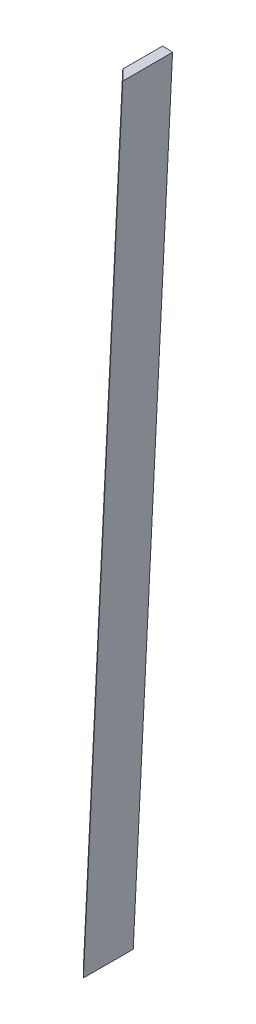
ISO-10303-21;
HEADER;
FILE_DESCRIPTION(('STEP AP214'),'2;1');
FILE_NAME('part.step','',(''),(''),'','','');
FILE_SCHEMA(('AUTOMOTIVE_DESIGN { 1 0 10303 214 1 1 1 1 }'));
ENDSEC;
DATA;
#1=APPLICATION_CONTEXT('core data for automotive mechanical design processes');
#2=APPLICATION_PROTOCOL_DEFINITION('international standard','automotive_design',2000,#1);
#3=PRODUCT_CONTEXT('',#1,'mechanical');
#4=PRODUCT('Part','Part','',(#3));
#5=PRODUCT_RELATED_PRODUCT_CATEGORY('part','',(#4));
#6=PRODUCT_DEFINITION_FORMATION('','',#4);
#7=PRODUCT_DEFINITION_CONTEXT('part definition',#1,'design');
#8=PRODUCT_DEFINITION('design','',#6,#7);
#9=PRODUCT_DEFINITION_SHAPE('','',#8);
#10=(LENGTH_UNIT() NAMED_UNIT(*) SI_UNIT(.MILLI.,.METRE.));
#11=(NAMED_UNIT(*) PLANE_ANGLE_UNIT() SI_UNIT($,.RADIAN.));
#12=(NAMED_UNIT(*) SI_UNIT($,.STERADIAN.) SOLID_ANGLE_UNIT());
#13=UNCERTAINTY_MEASURE_WITH_UNIT(LENGTH_MEASURE(1.E-05),#10,'distance_accuracy_value','');
#14=(GEOMETRIC_REPRESENTATION_CONTEXT(3) GLOBAL_UNCERTAINTY_ASSIGNED_CONTEXT((#13)) GLOBAL_UNIT_ASSIGNED_CONTEXT((#10,
#11,#12)) REPRESENTATION_CONTEXT('',''));
#15=CARTESIAN_POINT('',(0.,0.,0.));
#16=DIRECTION('',(0.,0.,1.));
#17=DIRECTION('',(1.,0.,0.));
#18=AXIS2_PLACEMENT_3D('',#15,#16,#17);
#19=CARTESIAN_POINT('',(183.577448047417,4000.68963069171,-264.150699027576));
#20=DIRECTION('',(0.000608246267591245,-3.00385009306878E-05,-0.999999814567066));
#21=DIRECTION('',(-0.999999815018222,0.,-0.000608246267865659));
#22=AXIS2_PLACEMENT_3D('',#19,#20,#21);
#23=PLANE('',#22);
#24=DIRECTION('',(-0.0493253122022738,-0.998782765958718,0.));
#25=VECTOR('',#24,1.);
#26=CARTESIAN_POINT('',(183.577448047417,4000.68963069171,-264.150699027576));
#27=LINE('',#26,#25);
#28=CARTESIAN_POINT('',(183.577448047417,4000.68963069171,-264.150699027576));
#29=VERTEX_POINT('',#28);
#30=CARTESIAN_POINT('',(-13.9642552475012,0.68963069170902,-264.150699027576));
#31=VERTEX_POINT('',#30);
#32=EDGE_CURVE('E34',#29,#31,#27,.T.);
#33=ORIENTED_EDGE('',*,*,#32,.T.);
#34=DIRECTION('',(0.9987825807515,-0.0493253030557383,0.000608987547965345));
#35=VECTOR('',#34,1.);
#36=CARTESIAN_POINT('',(-13.9642552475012,0.68963069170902,-264.150699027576));
#37=LINE('',#36,#35);
#38=CARTESIAN_POINT('',(-63.9033842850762,3.15589584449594,-264.181148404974));
#39=VERTEX_POINT('',#38);
#40=EDGE_CURVE('E71',#39,#31,#37,.T.);
#41=ORIENTED_EDGE('',*,*,#40,.F.);
#42=DIRECTION('',(-0.0493253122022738,-0.998782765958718,0.));
#43=VECTOR('',#42,1.);
#44=CARTESIAN_POINT('',(133.638319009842,4003.1558958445,-264.181148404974));
#45=LINE('',#44,#43);
#46=CARTESIAN_POINT('',(133.638319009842,4003.1558958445,-264.181148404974));
#47=VERTEX_POINT('',#46);
#48=EDGE_CURVE('E11',#47,#39,#45,.T.);
#49=ORIENTED_EDGE('',*,*,#48,.F.);
#50=DIRECTION('',(0.9987825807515,-0.0493253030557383,0.000608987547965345));
#51=VECTOR('',#50,1.);
#52=CARTESIAN_POINT('',(183.577448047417,4000.68963069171,-264.150699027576));
#53=LINE('',#52,#51);
#54=EDGE_CURVE('E72',#47,#29,#53,.T.);
#55=ORIENTED_EDGE('',*,*,#54,.T.);
#56=EDGE_LOOP('',(#33,#41,#49,#55));
#57=FACE_BOUND('',#56,.T.);
#58=ADVANCED_FACE('F31',(#57),#23,.T.);
#59=CARTESIAN_POINT('',(133.638319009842,4003.1558958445,-264.181148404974));
#60=DIRECTION('',(-0.9987825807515,0.0493253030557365,-0.000608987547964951));
#61=DIRECTION('',(-0.0493253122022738,-0.998782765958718,0.));
#62=AXIS2_PLACEMENT_3D('',#59,#60,#61);
#63=PLANE('',#62);
#64=ORIENTED_EDGE('',*,*,#48,.T.);
#65=DIRECTION('',(0.000608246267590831,-3.00385009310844E-05,-0.999999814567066));
#66=VECTOR('',#65,1.);
#67=CARTESIAN_POINT('',(-63.9033842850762,3.15589584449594,-264.181148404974));
#68=LINE('',#67,#66);
#69=CARTESIAN_POINT('',(-64.0250335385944,3.16190354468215,-64.1811854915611));
#70=VERTEX_POINT('',#69);
#71=EDGE_CURVE('E88',#70,#39,#68,.T.);
#72=ORIENTED_EDGE('',*,*,#71,.F.);
#73=DIRECTION('',(-0.0493253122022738,-0.998782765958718,0.));
#74=VECTOR('',#73,1.);
#75=CARTESIAN_POINT('',(133.516669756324,4003.16190354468,-64.1811854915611));
#76=LINE('',#75,#74);
#77=CARTESIAN_POINT('',(133.516669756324,4003.16190354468,-64.1811854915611));
#78=VERTEX_POINT('',#77);
#79=EDGE_CURVE('E39',#78,#70,#76,.T.);
#80=ORIENTED_EDGE('',*,*,#79,.F.);
#81=DIRECTION('',(0.000608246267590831,-3.00385009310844E-05,-0.999999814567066));
#82=VECTOR('',#81,1.);
#83=CARTESIAN_POINT('',(133.638319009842,4003.1558958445,-264.181148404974));
#84=LINE('',#83,#82);
#85=EDGE_CURVE('E77',#78,#47,#84,.T.);
#86=ORIENTED_EDGE('',*,*,#85,.T.);
#87=EDGE_LOOP('',(#64,#72,#80,#86));
#88=FACE_BOUND('',#87,.T.);
#89=ADVANCED_FACE('F103',(#88),#63,.T.);
#90=CARTESIAN_POINT('',(133.516669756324,4003.16190354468,-64.1811854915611));
#91=DIRECTION('',(-0.706676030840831,0.0348994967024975,0.706676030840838));
#92=DIRECTION('',(0.707106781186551,0.,0.707106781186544));
#93=AXIS2_PLACEMENT_3D('',#90,#91,#92);
#94=PLANE('',#93);
#95=ORIENTED_EDGE('',*,*,#79,.T.);
#96=DIRECTION('',(-0.705815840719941,0.0348570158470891,-0.707537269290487));
#97=VECTOR('',#96,1.);
#98=CARTESIAN_POINT('',(-64.0250335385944,3.16190354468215,-64.1811854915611));
#99=LINE('',#98,#97);
#100=CARTESIAN_POINT('',(-14.116316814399,0.697140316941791,-14.1507453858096));
#101=VERTEX_POINT('',#100);
#102=EDGE_CURVE('E84',#101,#70,#99,.T.);
#103=ORIENTED_EDGE('',*,*,#102,.F.);
#104=DIRECTION('',(-0.0493253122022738,-0.998782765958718,0.));
#105=VECTOR('',#104,1.);
#106=CARTESIAN_POINT('',(183.42538648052,4000.69714031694,-14.1507453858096));
#107=LINE('',#106,#105);
#108=CARTESIAN_POINT('',(183.42538648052,4000.69714031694,-14.1507453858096));
#109=VERTEX_POINT('',#108);
#110=EDGE_CURVE('E76',#109,#101,#107,.T.);
#111=ORIENTED_EDGE('',*,*,#110,.F.);
#112=DIRECTION('',(-0.705815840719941,0.0348570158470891,-0.707537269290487));
#113=VECTOR('',#112,1.);
#114=CARTESIAN_POINT('',(133.516669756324,4003.16190354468,-64.1811854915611));
#115=LINE('',#114,#113);
#116=EDGE_CURVE('E96',#109,#78,#115,.T.);
#117=ORIENTED_EDGE('',*,*,#116,.T.);
#118=EDGE_LOOP('',(#95,#103,#111,#117));
#119=FACE_BOUND('',#118,.T.);
#120=ADVANCED_FACE('F100',(#119),#94,.T.);
#121=CARTESIAN_POINT('',(183.42538648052,4000.69714031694,-14.1507453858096));
#122=DIRECTION('',(0.9987825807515,-0.0493253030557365,0.000608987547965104));
#123=DIRECTION('',(0.0493253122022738,0.998782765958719,0.));
#124=AXIS2_PLACEMENT_3D('',#121,#122,#123);
#125=PLANE('',#124);
#126=ORIENTED_EDGE('',*,*,#110,.T.);
#127=DIRECTION('',(-0.000608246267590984,3.00385009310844E-05,0.999999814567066));
#128=VECTOR('',#127,1.);
#129=CARTESIAN_POINT('',(-14.116316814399,0.697140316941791,-14.1507453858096));
#130=LINE('',#129,#128);
#131=EDGE_CURVE('E79',#31,#101,#130,.T.);
#132=ORIENTED_EDGE('',*,*,#131,.F.);
#133=ORIENTED_EDGE('',*,*,#32,.F.);
#134=DIRECTION('',(-0.000608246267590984,3.00385009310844E-05,0.999999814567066));
#135=VECTOR('',#134,1.);
#136=CARTESIAN_POINT('',(183.42538648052,4000.69714031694,-14.1507453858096));
#137=LINE('',#136,#135);
#138=EDGE_CURVE('E94',#29,#109,#137,.T.);
#139=ORIENTED_EDGE('',*,*,#138,.T.);
#140=EDGE_LOOP('',(#126,#132,#133,#139));
#141=FACE_BOUND('',#140,.T.);
#142=ADVANCED_FACE('F80',(#141),#125,.T.);
#143=CARTESIAN_POINT('',(183.577448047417,4000.68963069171,-264.150699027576));
#144=DIRECTION('',(-0.0493253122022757,-0.998782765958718,0.));
#145=DIRECTION('',(0.998782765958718,-0.0493253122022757,0.));
#146=AXIS2_PLACEMENT_3D('',#143,#144,#145);
#147=PLANE('',#146);
#148=ORIENTED_EDGE('',*,*,#54,.F.);
#149=ORIENTED_EDGE('',*,*,#85,.F.);
#150=ORIENTED_EDGE('',*,*,#116,.F.);
#151=ORIENTED_EDGE('',*,*,#138,.F.);
#152=EDGE_LOOP('',(#148,#149,#150,#151));
#153=FACE_BOUND('',#152,.T.);
#154=ADVANCED_FACE('F105',(#153),#147,.F.);
#155=CARTESIAN_POINT('',(-13.9642552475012,0.68963069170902,-264.150699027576));
#156=DIRECTION('',(-0.0493253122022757,-0.998782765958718,0.));
#157=DIRECTION('',(0.998782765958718,-0.0493253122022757,0.));
#158=AXIS2_PLACEMENT_3D('',#155,#156,#157);
#159=PLANE('',#158);
#160=ORIENTED_EDGE('',*,*,#40,.T.);
#161=ORIENTED_EDGE('',*,*,#131,.T.);
#162=ORIENTED_EDGE('',*,*,#102,.T.);
#163=ORIENTED_EDGE('',*,*,#71,.T.);
#164=EDGE_LOOP('',(#160,#161,#162,#163));
#165=FACE_BOUND('',#164,.T.);
#166=ADVANCED_FACE('F87',(#165),#159,.T.);
#167=CLOSED_SHELL('',(#58,#89,#120,#142,#154,#166));
#168=MANIFOLD_SOLID_BREP('B2',#167);
#169=ADVANCED_BREP_SHAPE_REPRESENTATION('',(#18,#168),#14);
#170=SHAPE_DEFINITION_REPRESENTATION(#9,#169);
ENDSEC;
END-ISO-10303-21;
